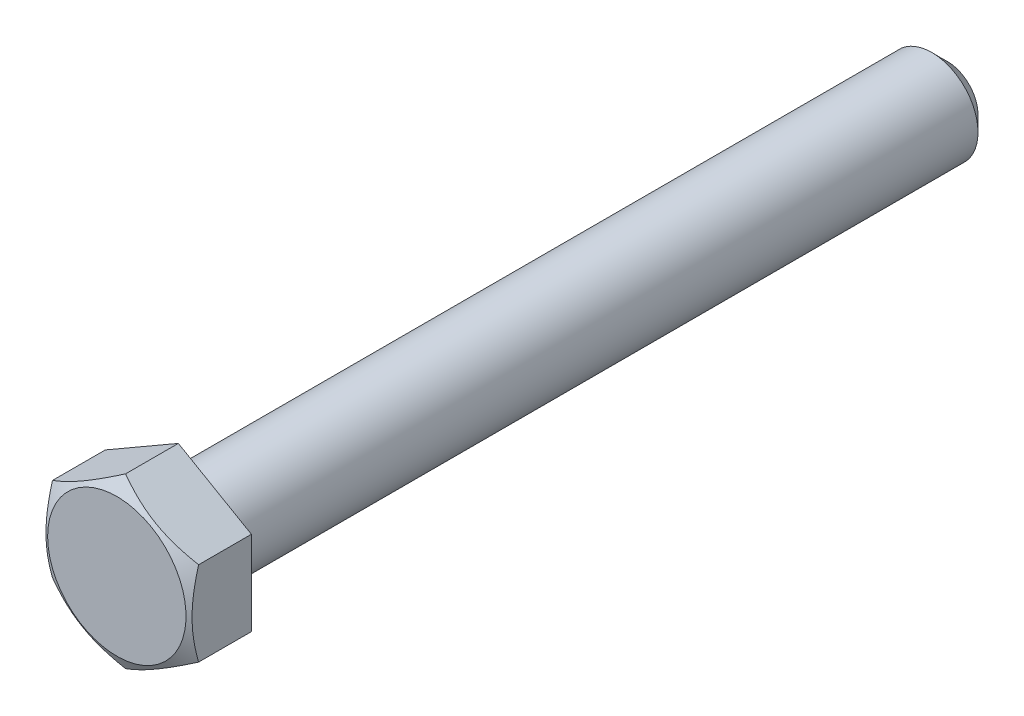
ISO-10303-21;
HEADER;
FILE_DESCRIPTION(('STEP AP214'),'2;1');
FILE_NAME('part.step','',(''),(''),'','','');
FILE_SCHEMA(('AUTOMOTIVE_DESIGN { 1 0 10303 214 1 1 1 1 }'));
ENDSEC;
DATA;
#1=APPLICATION_CONTEXT('core data for automotive mechanical design processes');
#2=APPLICATION_PROTOCOL_DEFINITION('international standard','automotive_design',2000,#1);
#3=PRODUCT_CONTEXT('',#1,'mechanical');
#4=PRODUCT('Part','Part','',(#3));
#5=PRODUCT_RELATED_PRODUCT_CATEGORY('part','',(#4));
#6=PRODUCT_DEFINITION_FORMATION('','',#4);
#7=PRODUCT_DEFINITION_CONTEXT('part definition',#1,'design');
#8=PRODUCT_DEFINITION('design','',#6,#7);
#9=PRODUCT_DEFINITION_SHAPE('','',#8);
#10=(LENGTH_UNIT() NAMED_UNIT(*) SI_UNIT(.MILLI.,.METRE.));
#11=(NAMED_UNIT(*) PLANE_ANGLE_UNIT() SI_UNIT($,.RADIAN.));
#12=(NAMED_UNIT(*) SI_UNIT($,.STERADIAN.) SOLID_ANGLE_UNIT());
#13=UNCERTAINTY_MEASURE_WITH_UNIT(LENGTH_MEASURE(1.E-05),#10,'distance_accuracy_value','');
#14=(GEOMETRIC_REPRESENTATION_CONTEXT(3) GLOBAL_UNCERTAINTY_ASSIGNED_CONTEXT((#13)) GLOBAL_UNIT_ASSIGNED_CONTEXT((#10,
#11,#12)) REPRESENTATION_CONTEXT('',''));
#15=CARTESIAN_POINT('',(0.,0.,0.));
#16=DIRECTION('',(0.,0.,1.));
#17=DIRECTION('',(1.,0.,0.));
#18=AXIS2_PLACEMENT_3D('',#15,#16,#17);
#19=CARTESIAN_POINT('',(0.,10.9696551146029,0.));
#20=DIRECTION('',(0.,0.,1.));
#21=DIRECTION('',(1.,0.,0.));
#22=AXIS2_PLACEMENT_3D('',#19,#20,#21);
#23=PLANE('',#22);
#24=DIRECTION('',(-0.866025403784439,0.5,0.));
#25=VECTOR('',#24,1.);
#26=CARTESIAN_POINT('',(9.5,5.48482755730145,0.));
#27=LINE('',#26,#25);
#28=CARTESIAN_POINT('',(9.5,5.48482755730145,0.));
#29=VERTEX_POINT('',#28);
#30=CARTESIAN_POINT('',(0.,10.9696551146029,0.));
#31=VERTEX_POINT('',#30);
#32=EDGE_CURVE('E77',#29,#31,#27,.T.);
#33=ORIENTED_EDGE('',*,*,#32,.F.);
#34=DIRECTION('',(0.,1.,0.));
#35=VECTOR('',#34,1.);
#36=CARTESIAN_POINT('',(9.5,-5.48482755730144,0.));
#37=LINE('',#36,#35);
#38=CARTESIAN_POINT('',(9.5,-5.48482755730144,0.));
#39=VERTEX_POINT('',#38);
#40=EDGE_CURVE('E82',#39,#29,#37,.T.);
#41=ORIENTED_EDGE('',*,*,#40,.F.);
#42=DIRECTION('',(0.866025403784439,0.5,0.));
#43=VECTOR('',#42,1.);
#44=CARTESIAN_POINT('',(0.,-10.9696551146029,0.));
#45=LINE('',#44,#43);
#46=CARTESIAN_POINT('',(0.,-10.9696551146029,0.));
#47=VERTEX_POINT('',#46);
#48=EDGE_CURVE('E88',#47,#39,#45,.T.);
#49=ORIENTED_EDGE('',*,*,#48,.F.);
#50=DIRECTION('',(0.866025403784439,-0.5,0.));
#51=VECTOR('',#50,1.);
#52=CARTESIAN_POINT('',(-9.5,-5.48482755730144,0.));
#53=LINE('',#52,#51);
#54=CARTESIAN_POINT('',(-9.5,-5.48482755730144,0.));
#55=VERTEX_POINT('',#54);
#56=EDGE_CURVE('E199',#55,#47,#53,.T.);
#57=ORIENTED_EDGE('',*,*,#56,.F.);
#58=DIRECTION('',(0.,-1.,0.));
#59=VECTOR('',#58,1.);
#60=CARTESIAN_POINT('',(-9.5,5.48482755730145,0.));
#61=LINE('',#60,#59);
#62=CARTESIAN_POINT('',(-9.5,5.48482755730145,0.));
#63=VERTEX_POINT('',#62);
#64=EDGE_CURVE('E209',#63,#55,#61,.T.);
#65=ORIENTED_EDGE('',*,*,#64,.F.);
#66=DIRECTION('',(-0.866025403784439,-0.5,0.));
#67=VECTOR('',#66,1.);
#68=CARTESIAN_POINT('',(0.,10.9696551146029,0.));
#69=LINE('',#68,#67);
#70=EDGE_CURVE('E207',#31,#63,#69,.T.);
#71=ORIENTED_EDGE('',*,*,#70,.F.);
#72=EDGE_LOOP('',(#33,#41,#49,#57,#65,#71));
#73=FACE_BOUND('',#72,.T.);
#74=CARTESIAN_POINT('',(0.,0.,0.));
#75=DIRECTION('',(0.,0.,1.));
#76=DIRECTION('',(1.,0.,0.));
#77=AXIS2_PLACEMENT_3D('',#74,#75,#76);
#78=CIRCLE('',#77,6.);
#79=CARTESIAN_POINT('',(6.,0.,0.));
#80=VERTEX_POINT('',#79);
#81=EDGE_CURVE('E98',#80,#80,#78,.F.);
#82=ORIENTED_EDGE('',*,*,#81,.F.);
#83=EDGE_LOOP('',(#82));
#84=FACE_BOUND('',#83,.T.);
#85=ADVANCED_FACE('F14',(#73,#84),#23,.F.);
#86=CARTESIAN_POINT('',(9.5,5.48482755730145,8.));
#87=DIRECTION('',(-0.5,-0.866025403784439,0.));
#88=DIRECTION('',(0.866025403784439,-0.5,0.));
#89=AXIS2_PLACEMENT_3D('',#86,#87,#88);
#90=PLANE('',#89);
#91=DIRECTION('',(0.,0.,-1.));
#92=VECTOR('',#91,1.);
#93=CARTESIAN_POINT('',(0.,10.9696551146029,8.));
#94=LINE('',#93,#92);
#95=CARTESIAN_POINT('',(0.,10.9696551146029,6.86281908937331));
#96=VERTEX_POINT('',#95);
#97=EDGE_CURVE('E76',#96,#31,#94,.T.);
#98=ORIENTED_EDGE('',*,*,#97,.F.);
#99=CARTESIAN_POINT('',(-0.0002,10.9697705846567,6.86275242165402));
#100=CARTESIAN_POINT('',(0.208630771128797,10.8492020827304,6.93235142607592));
#101=CARTESIAN_POINT('',(0.418240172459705,10.7281840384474,6.99879155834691));
#102=CARTESIAN_POINT('',(0.839139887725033,10.4851774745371,7.1244775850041));
#103=CARTESIAN_POINT('',(1.05043073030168,10.3631886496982,7.18372111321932));
#104=CARTESIAN_POINT('',(1.68770779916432,9.99525656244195,7.34951029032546));
#105=CARTESIAN_POINT('',(2.11620976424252,9.74786083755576,7.44381042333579));
#106=CARTESIAN_POINT('',(2.75744333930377,9.37764446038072,7.55438616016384));
#107=CARTESIAN_POINT('',(2.96825921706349,9.2559298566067,7.58588503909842));
#108=CARTESIAN_POINT('',(3.39086703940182,9.01193711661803,7.63870666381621));
#109=CARTESIAN_POINT('',(3.60265900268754,8.88965896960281,7.66002921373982));
#110=CARTESIAN_POINT('',(4.02659621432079,8.64489870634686,7.69195184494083));
#111=CARTESIAN_POINT('',(4.23874074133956,8.52241700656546,7.70256466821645));
#112=CARTESIAN_POINT('',(4.66322575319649,8.27734047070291,7.71284233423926));
#113=CARTESIAN_POINT('',(4.87556623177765,8.15474563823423,7.71250751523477));
#114=CARTESIAN_POINT('',(5.27254199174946,7.92555157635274,7.70165149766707));
#115=CARTESIAN_POINT('',(5.45720529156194,7.81893617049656,7.69245459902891));
#116=CARTESIAN_POINT('',(5.82610000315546,7.60595470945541,7.6659594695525));
#117=CARTESIAN_POINT('',(6.01033138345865,7.49958867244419,7.64866066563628));
#118=CARTESIAN_POINT('',(6.56231167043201,7.18090270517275,7.58502038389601));
#119=CARTESIAN_POINT('',(6.92908353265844,6.96914687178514,7.52694296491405));
#120=CARTESIAN_POINT('',(7.66651782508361,6.54338898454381,7.38174885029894));
#121=CARTESIAN_POINT('',(8.03708614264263,6.32944126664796,7.29401669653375));
#122=CARTESIAN_POINT('',(8.77269671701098,5.90473630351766,7.09490112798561));
#123=CARTESIAN_POINT('',(9.137748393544,5.6939736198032,6.98356447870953));
#124=CARTESIAN_POINT('',(9.5002,5.48471208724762,6.86275242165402));
#125=B_SPLINE_CURVE_WITH_KNOTS('',3,(#99,#100,#101,#102,#103,#104,#105,#106,#107,#108,#109,#110,
#111,#112,#113,#114,#115,#116,#117,#118,#119,#120,#121,#122,#123,#124),.UNSPECIFIED.,.F.,.F.,(4,
2,2,2,2,2,2,2,2,2,2,2,4),(0.,0.752880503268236,1.50600787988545,3.0154687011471,
3.75167336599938,4.48789219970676,5.22323407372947,5.95855322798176,6.59868084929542,
7.23885375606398,8.52010929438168,9.82978009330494,11.1368800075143),.UNSPECIFIED.);
#126=CARTESIAN_POINT('',(9.5,5.48482755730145,6.86281908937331));
#127=VERTEX_POINT('',#126);
#128=EDGE_CURVE('E68',#96,#127,#125,.T.);
#129=ORIENTED_EDGE('',*,*,#128,.T.);
#130=DIRECTION('',(0.,0.,-1.));
#131=VECTOR('',#130,1.);
#132=CARTESIAN_POINT('',(9.5,5.48482755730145,8.));
#133=LINE('',#132,#131);
#134=EDGE_CURVE('E37',#127,#29,#133,.T.);
#135=ORIENTED_EDGE('',*,*,#134,.T.);
#136=ORIENTED_EDGE('',*,*,#32,.T.);
#137=EDGE_LOOP('',(#98,#129,#135,#136));
#138=FACE_BOUND('',#137,.T.);
#139=ADVANCED_FACE('F75',(#138),#90,.F.);
#140=CARTESIAN_POINT('',(0.,10.9696551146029,8.));
#141=DIRECTION('',(0.5,-0.866025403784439,0.));
#142=DIRECTION('',(0.866025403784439,0.5,0.));
#143=AXIS2_PLACEMENT_3D('',#140,#141,#142);
#144=PLANE('',#143);
#145=DIRECTION('',(0.,0.,-1.));
#146=VECTOR('',#145,1.);
#147=CARTESIAN_POINT('',(-9.5,5.48482755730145,8.));
#148=LINE('',#147,#146);
#149=CARTESIAN_POINT('',(-9.5,5.48482755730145,6.86281908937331));
#150=VERTEX_POINT('',#149);
#151=EDGE_CURVE('E95',#150,#63,#148,.T.);
#152=ORIENTED_EDGE('',*,*,#151,.F.);
#153=CARTESIAN_POINT('',(-9.5002,5.48471208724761,6.86275242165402));
#154=CARTESIAN_POINT('',(-9.2913692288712,5.6052805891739,6.93235142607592));
#155=CARTESIAN_POINT('',(-9.0817598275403,5.72629863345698,6.99879155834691));
#156=CARTESIAN_POINT('',(-8.66086011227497,5.96930519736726,7.1244775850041));
#157=CARTESIAN_POINT('',(-8.44956926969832,6.09129402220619,7.18372111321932));
#158=CARTESIAN_POINT('',(-7.81229220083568,6.4592261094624,7.34951029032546));
#159=CARTESIAN_POINT('',(-7.38379023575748,6.70662183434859,7.44381042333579));
#160=CARTESIAN_POINT('',(-6.74255666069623,7.07683821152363,7.55438616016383));
#161=CARTESIAN_POINT('',(-6.53174078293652,7.19855281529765,7.58588503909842));
#162=CARTESIAN_POINT('',(-6.10913296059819,7.44254555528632,7.6387066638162));
#163=CARTESIAN_POINT('',(-5.89734099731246,7.56482370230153,7.66002921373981));
#164=CARTESIAN_POINT('',(-5.47340378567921,7.80958396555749,7.69195184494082));
#165=CARTESIAN_POINT('',(-5.26125925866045,7.93206566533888,7.70256466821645));
#166=CARTESIAN_POINT('',(-4.83677424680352,8.17714220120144,7.71284233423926));
#167=CARTESIAN_POINT('',(-4.62443376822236,8.29973703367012,7.71250751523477));
#168=CARTESIAN_POINT('',(-4.22745800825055,8.52893109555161,7.70165149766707));
#169=CARTESIAN_POINT('',(-4.04279470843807,8.63554650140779,7.6924545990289));
#170=CARTESIAN_POINT('',(-3.67389999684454,8.84852796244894,7.6659594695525));
#171=CARTESIAN_POINT('',(-3.48966861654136,8.95489399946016,7.64866066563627));
#172=CARTESIAN_POINT('',(-2.937688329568,9.27357996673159,7.585020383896));
#173=CARTESIAN_POINT('',(-2.57091646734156,9.48533580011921,7.52694296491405));
#174=CARTESIAN_POINT('',(-1.83348217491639,9.91109368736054,7.38174885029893));
#175=CARTESIAN_POINT('',(-1.46291385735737,10.1250414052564,7.29401669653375));
#176=CARTESIAN_POINT('',(-0.727303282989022,10.5497463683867,7.0949011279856));
#177=CARTESIAN_POINT('',(-0.362251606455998,10.7605090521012,6.98356447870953));
#178=CARTESIAN_POINT('',(0.000200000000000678,10.9697705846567,6.86275242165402));
#179=B_SPLINE_CURVE_WITH_KNOTS('',3,(#153,#154,#155,#156,#157,#158,#159,#160,#161,#162,#163,
#164,#165,#166,#167,#168,#169,#170,#171,#172,#173,#174,#175,#176,#177,#178),.UNSPECIFIED.,.F.,
.F.,(4,2,2,2,2,2,2,2,2,2,2,2,4),(0.,0.752880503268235,1.50600787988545,3.0154687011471,
3.75167336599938,4.48789219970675,5.22323407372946,5.95855322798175,6.59868084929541,
7.23885375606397,8.52010929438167,9.82978009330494,11.1368800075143),.UNSPECIFIED.);
#180=EDGE_CURVE('E78',#150,#96,#179,.T.);
#181=ORIENTED_EDGE('',*,*,#180,.T.);
#182=ORIENTED_EDGE('',*,*,#97,.T.);
#183=ORIENTED_EDGE('',*,*,#70,.T.);
#184=EDGE_LOOP('',(#152,#181,#182,#183));
#185=FACE_BOUND('',#184,.T.);
#186=ADVANCED_FACE('F122',(#185),#144,.F.);
#187=CARTESIAN_POINT('',(-9.5,5.48482755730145,8.));
#188=DIRECTION('',(1.,0.,0.));
#189=DIRECTION('',(0.,0.,-1.));
#190=AXIS2_PLACEMENT_3D('',#187,#188,#189);
#191=PLANE('',#190);
#192=DIRECTION('',(0.,0.,-1.));
#193=VECTOR('',#192,1.);
#194=CARTESIAN_POINT('',(-9.5,-5.48482755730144,8.));
#195=LINE('',#194,#193);
#196=CARTESIAN_POINT('',(-9.5,-5.48482755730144,6.86281908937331));
#197=VERTEX_POINT('',#196);
#198=EDGE_CURVE('E93',#197,#55,#195,.T.);
#199=ORIENTED_EDGE('',*,*,#198,.F.);
#200=CARTESIAN_POINT('',(-9.5,-14.6169548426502,3.13127340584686));
#201=CARTESIAN_POINT('',(-9.5,-14.4099741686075,3.23146887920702));
#202=CARTESIAN_POINT('',(-9.5,-14.202747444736,3.33115583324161));
#203=CARTESIAN_POINT('',(-9.5,-13.7877505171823,3.52939728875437));
#204=CARTESIAN_POINT('',(-9.5,-13.5799803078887,3.62795177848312));
#205=CARTESIAN_POINT('',(-9.5,-12.9557203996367,3.92177017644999));
#206=CARTESIAN_POINT('',(-9.5,-12.5383444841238,4.11515839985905));
#207=CARTESIAN_POINT('',(-9.5,-11.6984328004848,4.49680738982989));
#208=CARTESIAN_POINT('',(-9.5,-11.275881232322,4.68503347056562));
#209=CARTESIAN_POINT('',(-9.5,-10.427377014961,5.05362894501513));
#210=CARTESIAN_POINT('',(-9.5,-10.0014245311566,5.23399871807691));
#211=CARTESIAN_POINT('',(-9.5,-9.1321608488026,5.59024054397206));
#212=CARTESIAN_POINT('',(-9.5,-8.68872080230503,5.76579995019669));
#213=CARTESIAN_POINT('',(-9.5,-7.79661127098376,6.10334897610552));
#214=CARTESIAN_POINT('',(-9.5,-7.34794119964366,6.26533705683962));
#215=CARTESIAN_POINT('',(-9.5,-6.44553024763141,6.57140492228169));
#216=CARTESIAN_POINT('',(-9.5,-5.9918021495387,6.71552198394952));
#217=CARTESIAN_POINT('',(-9.5,-5.07785587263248,6.98114937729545));
#218=CARTESIAN_POINT('',(-9.5,-4.61763982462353,7.10266695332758));
#219=CARTESIAN_POINT('',(-9.5,-3.69290280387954,7.31654154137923));
#220=CARTESIAN_POINT('',(-9.5,-3.22841826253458,7.40905177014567));
#221=CARTESIAN_POINT('',(-9.5,-2.52755616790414,7.52199749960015));
#222=CARTESIAN_POINT('',(-9.5,-2.29322816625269,7.55534437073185));
#223=CARTESIAN_POINT('',(-9.5,-1.82344730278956,7.61277502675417));
#224=CARTESIAN_POINT('',(-9.5,-1.58799455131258,7.6368597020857));
#225=CARTESIAN_POINT('',(-9.5,-1.11930437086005,7.67498999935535));
#226=CARTESIAN_POINT('',(-9.5,-0.886077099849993,7.68916002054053));
#227=CARTESIAN_POINT('',(-9.5,-0.419232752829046,7.70763310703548));
#228=CARTESIAN_POINT('',(-9.5,-0.185615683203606,7.71193633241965));
#229=CARTESIAN_POINT('',(-9.5,0.281592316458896,7.71057344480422));
#230=CARTESIAN_POINT('',(-9.5,0.515183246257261,7.70490724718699));
#231=CARTESIAN_POINT('',(-9.5,0.981922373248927,7.68374176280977));
#232=CARTESIAN_POINT('',(-9.5,1.2150705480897,7.66824199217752));
#233=CARTESIAN_POINT('',(-9.5,1.77895072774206,7.61918755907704));
#234=CARTESIAN_POINT('',(-9.5,2.10926686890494,7.5807701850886));
#235=CARTESIAN_POINT('',(-9.5,2.7673725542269,7.48631778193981));
#236=CARTESIAN_POINT('',(-9.5,3.09516173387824,7.43028025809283));
#237=CARTESIAN_POINT('',(-9.5,3.7479266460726,7.30258122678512));
#238=CARTESIAN_POINT('',(-9.5,4.07289990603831,7.23090720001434));
#239=CARTESIAN_POINT('',(-9.5,4.71955029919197,7.07411533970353));
#240=CARTESIAN_POINT('',(-9.5,5.04122748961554,6.98899774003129));
#241=CARTESIAN_POINT('',(-9.5,5.68830445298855,6.80538640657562));
#242=CARTESIAN_POINT('',(-9.5,6.01363245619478,6.70664147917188));
#243=CARTESIAN_POINT('',(-9.5,6.66108251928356,6.4992006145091));
#244=CARTESIAN_POINT('',(-9.5,6.98320455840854,6.39050461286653));
#245=CARTESIAN_POINT('',(-9.5,7.62440641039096,6.16486538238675));
#246=CARTESIAN_POINT('',(-9.5,7.94348725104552,6.04792506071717));
#247=CARTESIAN_POINT('',(-9.5,8.57902170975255,5.80714824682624));
#248=CARTESIAN_POINT('',(-9.5,8.89547535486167,5.68331182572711));
#249=CARTESIAN_POINT('',(-9.5,9.62674986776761,5.38942439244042));
#250=CARTESIAN_POINT('',(-9.5,10.0407133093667,5.21724339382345));
#251=CARTESIAN_POINT('',(-9.5,10.8652589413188,4.86494520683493));
#252=CARTESIAN_POINT('',(-9.5,11.2758409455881,4.68482758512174));
#253=CARTESIAN_POINT('',(-9.5,12.0942342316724,4.31820457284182));
#254=CARTESIAN_POINT('',(-9.5,12.5020449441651,4.1316979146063));
#255=CARTESIAN_POINT('',(-9.5,13.31526398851,3.75355025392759));
#256=CARTESIAN_POINT('',(-9.5,13.7206723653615,3.56190934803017));
#257=CARTESIAN_POINT('',(-9.5,14.5298828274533,3.17423557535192));
#258=CARTESIAN_POINT('',(-9.5,14.9336828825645,2.97819847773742));
#259=CARTESIAN_POINT('',(-9.5,15.7395764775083,2.58264906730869));
#260=CARTESIAN_POINT('',(-9.5,16.1416700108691,2.3831367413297));
#261=CARTESIAN_POINT('',(-9.5,17.3456966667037,1.78033515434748));
#262=CARTESIAN_POINT('',(-9.5,18.1454714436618,1.37273512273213));
#263=CARTESIAN_POINT('',(-9.5,19.6765506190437,0.58254582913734));
#264=CARTESIAN_POINT('',(-9.5,20.4081814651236,0.200586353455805));
#265=CARTESIAN_POINT('',(-9.5,21.8687212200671,-0.568553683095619));
#266=CARTESIAN_POINT('',(-9.5,22.5976300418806,-0.955734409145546));
#267=CARTESIAN_POINT('',(-9.5,24.0516280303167,-1.73318767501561));
#268=CARTESIAN_POINT('',(-9.5,24.7767221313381,-2.12345100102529));
#269=CARTESIAN_POINT('',(-9.5,26.2251609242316,-2.90712368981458));
#270=CARTESIAN_POINT('',(-9.5,26.9485057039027,-3.30053289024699));
#271=CARTESIAN_POINT('',(-9.5,27.671202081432,-3.69512170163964));
#272=B_SPLINE_CURVE_WITH_KNOTS('',3,(#200,#201,#202,#203,#204,#205,#206,#207,#208,#209,#210,
#211,#212,#213,#214,#215,#216,#217,#218,#219,#220,#221,#222,#223,#224,#225,#226,#227,#228,#229,
#230,#231,#232,#233,#234,#235,#236,#237,#238,#239,#240,#241,#242,#243,#244,#245,#246,#247,#248,
#249,#250,#251,#252,#253,#254,#255,#256,#257,#258,#259,#260,#261,#262,#263,#264,#265,#266,#267,
#268,#269,#270,#271),.UNSPECIFIED.,.F.,.F.,(4,2,2,2,2,2,2,2,2,2,2,2,2,2,2,2,2,2,2,2,2,2,2,2,2,2,
2,2,2,2,2,2,2,2,2,4),(0.,0.689869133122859,1.37974541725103,2.759708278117,4.14738140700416,
5.53498745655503,6.96559884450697,8.39637224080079,9.82410912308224,11.2513875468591,
12.670994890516,13.3809072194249,14.0907512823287,14.7915209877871,15.492279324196,
16.1930436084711,16.8938423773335,17.8909161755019,18.8881312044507,19.8861475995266,
20.8841466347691,21.9039067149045,22.923673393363,23.9430822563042,24.9624806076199,
26.307400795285,27.6523945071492,28.9976566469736,30.3428935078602,31.6894858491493,
33.0360832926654,35.7289597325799,38.2049401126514,40.6809990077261,43.1513353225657,
45.6215449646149),.UNSPECIFIED.);
#273=EDGE_CURVE('E160',#197,#150,#272,.T.);
#274=ORIENTED_EDGE('',*,*,#273,.T.);
#275=ORIENTED_EDGE('',*,*,#151,.T.);
#276=ORIENTED_EDGE('',*,*,#64,.T.);
#277=EDGE_LOOP('',(#199,#274,#275,#276));
#278=FACE_BOUND('',#277,.T.);
#279=ADVANCED_FACE('F179',(#278),#191,.F.);
#280=CARTESIAN_POINT('',(-9.5,-5.48482755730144,8.));
#281=DIRECTION('',(0.5,0.866025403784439,0.));
#282=DIRECTION('',(-0.866025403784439,0.5,0.));
#283=AXIS2_PLACEMENT_3D('',#280,#281,#282);
#284=PLANE('',#283);
#285=DIRECTION('',(0.,0.,-1.));
#286=VECTOR('',#285,1.);
#287=CARTESIAN_POINT('',(0.,-10.9696551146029,8.));
#288=LINE('',#287,#286);
#289=CARTESIAN_POINT('',(0.,-10.9696551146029,6.86281908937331));
#290=VERTEX_POINT('',#289);
#291=EDGE_CURVE('E86',#290,#47,#288,.T.);
#292=ORIENTED_EDGE('',*,*,#291,.F.);
#293=CARTESIAN_POINT('',(0.000199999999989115,-10.9697705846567,6.86275242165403));
#294=CARTESIAN_POINT('',(-0.20863077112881,-10.8492020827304,6.93235142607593));
#295=CARTESIAN_POINT('',(-0.418240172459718,-10.7281840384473,6.99879155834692));
#296=CARTESIAN_POINT('',(-0.839139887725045,-10.4851774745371,7.12447758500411));
#297=CARTESIAN_POINT('',(-1.05043073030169,-10.3631886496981,7.18372111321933));
#298=CARTESIAN_POINT('',(-1.68770779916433,-9.99525656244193,7.34951029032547));
#299=CARTESIAN_POINT('',(-2.11620976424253,-9.74786083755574,7.4438104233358));
#300=CARTESIAN_POINT('',(-2.75744333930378,-9.3776444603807,7.55438616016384));
#301=CARTESIAN_POINT('',(-2.96825921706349,-9.25592985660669,7.58588503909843));
#302=CARTESIAN_POINT('',(-3.39086703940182,-9.01193711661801,7.63870666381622));
#303=CARTESIAN_POINT('',(-3.60265900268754,-8.8896589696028,7.66002921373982));
#304=CARTESIAN_POINT('',(-4.0265962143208,-8.64489870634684,7.69195184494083));
#305=CARTESIAN_POINT('',(-4.23874074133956,-8.52241700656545,7.70256466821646));
#306=CARTESIAN_POINT('',(-4.66322575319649,-8.2773404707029,7.71284233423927));
#307=CARTESIAN_POINT('',(-4.87556623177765,-8.15474563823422,7.71250751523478));
#308=CARTESIAN_POINT('',(-5.27254199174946,-7.92555157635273,7.70165149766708));
#309=CARTESIAN_POINT('',(-5.45720529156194,-7.81893617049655,7.69245459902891));
#310=CARTESIAN_POINT('',(-5.82610000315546,-7.60595470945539,7.66595946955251));
#311=CARTESIAN_POINT('',(-6.01033138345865,-7.49958867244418,7.64866066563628));
#312=CARTESIAN_POINT('',(-6.56231167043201,-7.18090270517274,7.58502038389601));
#313=CARTESIAN_POINT('',(-6.92908353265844,-6.96914687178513,7.52694296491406));
#314=CARTESIAN_POINT('',(-7.66651782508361,-6.5433889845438,7.38174885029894));
#315=CARTESIAN_POINT('',(-8.03708614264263,-6.32944126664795,7.29401669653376));
#316=CARTESIAN_POINT('',(-8.77269671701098,-5.90473630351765,7.09490112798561));
#317=CARTESIAN_POINT('',(-9.137748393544,-5.69397361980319,6.98356447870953));
#318=CARTESIAN_POINT('',(-9.5002,-5.48471208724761,6.86275242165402));
#319=B_SPLINE_CURVE_WITH_KNOTS('',3,(#293,#294,#295,#296,#297,#298,#299,#300,#301,#302,#303,
#304,#305,#306,#307,#308,#309,#310,#311,#312,#313,#314,#315,#316,#317,#318),.UNSPECIFIED.,.F.,
.F.,(4,2,2,2,2,2,2,2,2,2,2,2,4),(0.,0.752880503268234,1.50600787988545,3.01546870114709,
3.75167336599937,4.48789219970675,5.22323407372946,5.95855322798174,6.5986808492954,
7.23885375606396,8.52010929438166,9.82978009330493,11.1368800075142),.UNSPECIFIED.);
#320=EDGE_CURVE('E154',#290,#197,#319,.T.);
#321=ORIENTED_EDGE('',*,*,#320,.T.);
#322=ORIENTED_EDGE('',*,*,#198,.T.);
#323=ORIENTED_EDGE('',*,*,#56,.T.);
#324=EDGE_LOOP('',(#292,#321,#322,#323));
#325=FACE_BOUND('',#324,.T.);
#326=ADVANCED_FACE('F184',(#325),#284,.F.);
#327=CARTESIAN_POINT('',(0.,-10.9696551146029,8.));
#328=DIRECTION('',(-0.5,0.866025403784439,0.));
#329=DIRECTION('',(-0.866025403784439,-0.5,0.));
#330=AXIS2_PLACEMENT_3D('',#327,#328,#329);
#331=PLANE('',#330);
#332=DIRECTION('',(0.,0.,-1.));
#333=VECTOR('',#332,1.);
#334=CARTESIAN_POINT('',(9.5,-5.48482755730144,8.));
#335=LINE('',#334,#333);
#336=CARTESIAN_POINT('',(9.5,-5.48482755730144,6.86281908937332));
#337=VERTEX_POINT('',#336);
#338=EDGE_CURVE('E84',#337,#39,#335,.T.);
#339=ORIENTED_EDGE('',*,*,#338,.F.);
#340=CARTESIAN_POINT('',(9.5002,-5.4847120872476,6.86275242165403));
#341=CARTESIAN_POINT('',(9.2913692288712,-5.6052805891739,6.93235142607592));
#342=CARTESIAN_POINT('',(9.0817598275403,-5.72629863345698,6.99879155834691));
#343=CARTESIAN_POINT('',(8.66086011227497,-5.96930519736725,7.1244775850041));
#344=CARTESIAN_POINT('',(8.44956926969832,-6.09129402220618,7.18372111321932));
#345=CARTESIAN_POINT('',(7.81229220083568,-6.4592261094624,7.34951029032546));
#346=CARTESIAN_POINT('',(7.38379023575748,-6.70662183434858,7.4438104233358));
#347=CARTESIAN_POINT('',(6.74255666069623,-7.07683821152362,7.55438616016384));
#348=CARTESIAN_POINT('',(6.53174078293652,-7.19855281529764,7.58588503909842));
#349=CARTESIAN_POINT('',(6.10913296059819,-7.44254555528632,7.63870666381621));
#350=CARTESIAN_POINT('',(5.89734099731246,-7.56482370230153,7.66002921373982));
#351=CARTESIAN_POINT('',(5.47340378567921,-7.80958396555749,7.69195184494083));
#352=CARTESIAN_POINT('',(5.26125925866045,-7.93206566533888,7.70256466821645));
#353=CARTESIAN_POINT('',(4.83677424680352,-8.17714220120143,7.71284233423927));
#354=CARTESIAN_POINT('',(4.62443376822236,-8.29973703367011,7.71250751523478));
#355=CARTESIAN_POINT('',(4.22745800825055,-8.5289310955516,7.70165149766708));
#356=CARTESIAN_POINT('',(4.04279470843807,-8.63554650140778,7.69245459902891));
#357=CARTESIAN_POINT('',(3.67389999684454,-8.84852796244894,7.6659594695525));
#358=CARTESIAN_POINT('',(3.48966861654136,-8.95489399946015,7.64866066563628));
#359=CARTESIAN_POINT('',(2.937688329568,-9.27357996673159,7.58502038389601));
#360=CARTESIAN_POINT('',(2.57091646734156,-9.4853358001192,7.52694296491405));
#361=CARTESIAN_POINT('',(1.83348217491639,-9.91109368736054,7.38174885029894));
#362=CARTESIAN_POINT('',(1.46291385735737,-10.1250414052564,7.29401669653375));
#363=CARTESIAN_POINT('',(0.727303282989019,-10.5497463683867,7.09490112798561));
#364=CARTESIAN_POINT('',(0.362251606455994,-10.7605090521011,6.98356447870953));
#365=CARTESIAN_POINT('',(-0.000200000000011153,-10.9697705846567,6.86275242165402));
#366=B_SPLINE_CURVE_WITH_KNOTS('',3,(#340,#341,#342,#343,#344,#345,#346,#347,#348,#349,#350,
#351,#352,#353,#354,#355,#356,#357,#358,#359,#360,#361,#362,#363,#364,#365),.UNSPECIFIED.,.F.,
.F.,(4,2,2,2,2,2,2,2,2,2,2,2,4),(0.,0.752880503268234,1.50600787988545,3.0154687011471,
3.75167336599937,4.48789219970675,5.22323407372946,5.95855322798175,6.59868084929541,
7.23885375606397,8.52010929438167,9.82978009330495,11.1368800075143),.UNSPECIFIED.);
#367=EDGE_CURVE('E29',#337,#290,#366,.T.);
#368=ORIENTED_EDGE('',*,*,#367,.T.);
#369=ORIENTED_EDGE('',*,*,#291,.T.);
#370=ORIENTED_EDGE('',*,*,#48,.T.);
#371=EDGE_LOOP('',(#339,#368,#369,#370));
#372=FACE_BOUND('',#371,.T.);
#373=ADVANCED_FACE('F131',(#372),#331,.F.);
#374=CARTESIAN_POINT('',(9.5,-5.48482755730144,8.));
#375=DIRECTION('',(-1.,0.,0.));
#376=DIRECTION('',(0.,-1.,0.));
#377=AXIS2_PLACEMENT_3D('',#374,#375,#376);
#378=PLANE('',#377);
#379=ORIENTED_EDGE('',*,*,#134,.F.);
#380=CARTESIAN_POINT('',(9.5,-14.6169548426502,3.13127340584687));
#381=CARTESIAN_POINT('',(9.5,-14.4099741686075,3.23146887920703));
#382=CARTESIAN_POINT('',(9.49999999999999,-14.202747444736,3.33115583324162));
#383=CARTESIAN_POINT('',(9.49999999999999,-13.7877505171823,3.52939728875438));
#384=CARTESIAN_POINT('',(9.49999999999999,-13.5799803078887,3.62795177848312));
#385=CARTESIAN_POINT('',(9.49999999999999,-12.9557203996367,3.92177017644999));
#386=CARTESIAN_POINT('',(9.5,-12.5383444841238,4.11515839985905));
#387=CARTESIAN_POINT('',(9.5,-11.6984328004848,4.4968073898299));
#388=CARTESIAN_POINT('',(9.5,-11.275881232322,4.68503347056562));
#389=CARTESIAN_POINT('',(9.5,-10.427377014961,5.05362894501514));
#390=CARTESIAN_POINT('',(9.5,-10.0014245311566,5.23399871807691));
#391=CARTESIAN_POINT('',(9.5,-9.1321608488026,5.59024054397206));
#392=CARTESIAN_POINT('',(9.5,-8.68872080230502,5.7657999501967));
#393=CARTESIAN_POINT('',(9.5,-7.79661127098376,6.10334897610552));
#394=CARTESIAN_POINT('',(9.5,-7.34794119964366,6.26533705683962));
#395=CARTESIAN_POINT('',(9.5,-6.44553024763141,6.57140492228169));
#396=CARTESIAN_POINT('',(9.5,-5.9918021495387,6.71552198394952));
#397=CARTESIAN_POINT('',(9.5,-5.07785587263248,6.98114937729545));
#398=CARTESIAN_POINT('',(9.5,-4.61763982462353,7.10266695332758));
#399=CARTESIAN_POINT('',(9.5,-3.69290280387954,7.31654154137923));
#400=CARTESIAN_POINT('',(9.5,-3.22841826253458,7.40905177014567));
#401=CARTESIAN_POINT('',(9.5,-2.52755616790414,7.52199749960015));
#402=CARTESIAN_POINT('',(9.5,-2.29322816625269,7.55534437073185));
#403=CARTESIAN_POINT('',(9.5,-1.82344730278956,7.61277502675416));
#404=CARTESIAN_POINT('',(9.5,-1.58799455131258,7.63685970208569));
#405=CARTESIAN_POINT('',(9.5,-1.11930437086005,7.67498999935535));
#406=CARTESIAN_POINT('',(9.5,-0.886077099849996,7.68916002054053));
#407=CARTESIAN_POINT('',(9.5,-0.419232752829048,7.70763310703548));
#408=CARTESIAN_POINT('',(9.5,-0.185615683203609,7.71193633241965));
#409=CARTESIAN_POINT('',(9.5,0.281592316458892,7.71057344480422));
#410=CARTESIAN_POINT('',(9.50000000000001,0.515183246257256,7.70490724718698));
#411=CARTESIAN_POINT('',(9.5,0.981922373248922,7.68374176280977));
#412=CARTESIAN_POINT('',(9.5,1.2150705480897,7.66824199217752));
#413=CARTESIAN_POINT('',(9.5,1.77895072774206,7.61918755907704));
#414=CARTESIAN_POINT('',(9.5,2.10926686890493,7.5807701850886));
#415=CARTESIAN_POINT('',(9.50000000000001,2.76737255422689,7.4863177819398));
#416=CARTESIAN_POINT('',(9.50000000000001,3.09516173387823,7.43028025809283));
#417=CARTESIAN_POINT('',(9.50000000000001,3.74792664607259,7.30258122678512));
#418=CARTESIAN_POINT('',(9.50000000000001,4.0728999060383,7.23090720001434));
#419=CARTESIAN_POINT('',(9.50000000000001,4.71955029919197,7.07411533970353));
#420=CARTESIAN_POINT('',(9.50000000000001,5.04122748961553,6.98899774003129));
#421=CARTESIAN_POINT('',(9.50000000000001,5.68830445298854,6.80538640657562));
#422=CARTESIAN_POINT('',(9.50000000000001,6.01363245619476,6.70664147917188));
#423=CARTESIAN_POINT('',(9.50000000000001,6.66108251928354,6.4992006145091));
#424=CARTESIAN_POINT('',(9.50000000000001,6.98320455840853,6.39050461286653));
#425=CARTESIAN_POINT('',(9.50000000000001,7.62440641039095,6.16486538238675));
#426=CARTESIAN_POINT('',(9.50000000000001,7.94348725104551,6.04792506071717));
#427=CARTESIAN_POINT('',(9.50000000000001,8.57902170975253,5.80714824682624));
#428=CARTESIAN_POINT('',(9.5,8.89547535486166,5.68331182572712));
#429=CARTESIAN_POINT('',(9.5,9.6267498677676,5.38942439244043));
#430=CARTESIAN_POINT('',(9.50000000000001,10.0407133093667,5.21724339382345));
#431=CARTESIAN_POINT('',(9.50000000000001,10.8652589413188,4.86494520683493));
#432=CARTESIAN_POINT('',(9.50000000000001,11.2758409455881,4.68482758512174));
#433=CARTESIAN_POINT('',(9.50000000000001,12.0942342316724,4.31820457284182));
#434=CARTESIAN_POINT('',(9.50000000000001,12.502044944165,4.1316979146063));
#435=CARTESIAN_POINT('',(9.50000000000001,13.3152639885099,3.75355025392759));
#436=CARTESIAN_POINT('',(9.50000000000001,13.7206723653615,3.56190934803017));
#437=CARTESIAN_POINT('',(9.50000000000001,14.5298828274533,3.17423557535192));
#438=CARTESIAN_POINT('',(9.50000000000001,14.9336828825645,2.97819847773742));
#439=CARTESIAN_POINT('',(9.50000000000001,15.7395764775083,2.58264906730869));
#440=CARTESIAN_POINT('',(9.50000000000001,16.1416700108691,2.3831367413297));
#441=CARTESIAN_POINT('',(9.50000000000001,17.3456966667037,1.78033515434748));
#442=CARTESIAN_POINT('',(9.50000000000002,18.1454714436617,1.37273512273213));
#443=CARTESIAN_POINT('',(9.50000000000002,19.6765506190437,0.58254582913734));
#444=CARTESIAN_POINT('',(9.50000000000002,20.4081814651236,0.200586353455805));
#445=CARTESIAN_POINT('',(9.50000000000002,21.8687212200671,-0.568553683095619));
#446=CARTESIAN_POINT('',(9.50000000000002,22.5976300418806,-0.955734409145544));
#447=CARTESIAN_POINT('',(9.50000000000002,24.0516280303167,-1.73318767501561));
#448=CARTESIAN_POINT('',(9.50000000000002,24.776722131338,-2.12345100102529));
#449=CARTESIAN_POINT('',(9.50000000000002,26.2251609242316,-2.90712368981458));
#450=CARTESIAN_POINT('',(9.50000000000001,26.9485057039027,-3.30053289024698));
#451=CARTESIAN_POINT('',(9.5,27.671202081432,-3.69512170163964));
#452=B_SPLINE_CURVE_WITH_KNOTS('',3,(#380,#381,#382,#383,#384,#385,#386,#387,#388,#389,#390,
#391,#392,#393,#394,#395,#396,#397,#398,#399,#400,#401,#402,#403,#404,#405,#406,#407,#408,#409,
#410,#411,#412,#413,#414,#415,#416,#417,#418,#419,#420,#421,#422,#423,#424,#425,#426,#427,#428,
#429,#430,#431,#432,#433,#434,#435,#436,#437,#438,#439,#440,#441,#442,#443,#444,#445,#446,#447,
#448,#449,#450,#451),.UNSPECIFIED.,.F.,.F.,(4,2,2,2,2,2,2,2,2,2,2,2,2,2,2,2,2,2,2,2,2,2,2,2,2,2,
2,2,2,2,2,2,2,2,2,4),(0.,0.689869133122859,1.37974541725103,2.759708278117,4.14738140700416,
5.53498745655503,6.96559884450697,8.39637224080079,9.82410912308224,11.251387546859,
12.670994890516,13.3809072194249,14.0907512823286,14.7915209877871,15.492279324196,
16.1930436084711,16.8938423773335,17.8909161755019,18.8881312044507,19.8861475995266,
20.8841466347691,21.9039067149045,22.923673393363,23.9430822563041,24.9624806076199,
26.307400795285,27.6523945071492,28.9976566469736,30.3428935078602,31.6894858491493,
33.0360832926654,35.7289597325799,38.2049401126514,40.6809990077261,43.1513353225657,
45.6215449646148),.UNSPECIFIED.);
#453=EDGE_CURVE('E66',#127,#337,#452,.F.);
#454=ORIENTED_EDGE('',*,*,#453,.T.);
#455=ORIENTED_EDGE('',*,*,#338,.T.);
#456=ORIENTED_EDGE('',*,*,#40,.T.);
#457=EDGE_LOOP('',(#379,#454,#455,#456));
#458=FACE_BOUND('',#457,.T.);
#459=ADVANCED_FACE('F80',(#458),#378,.F.);
#460=CARTESIAN_POINT('',(0.,0.,8.));
#461=DIRECTION('',(0.,0.,-1.));
#462=DIRECTION('',(-1.,0.,0.));
#463=AXIS2_PLACEMENT_3D('',#460,#461,#462);
#464=CONICAL_SURFACE('',#463,9.,1.0471975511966);
#465=CARTESIAN_POINT('',(0.,0.,8.));
#466=DIRECTION('',(0.,0.,-1.));
#467=DIRECTION('',(-1.,0.,0.));
#468=AXIS2_PLACEMENT_3D('',#465,#466,#467);
#469=CIRCLE('',#468,9.);
#470=CARTESIAN_POINT('',(-9.,0.,8.));
#471=VERTEX_POINT('',#470);
#472=EDGE_CURVE('E72',#471,#471,#469,.T.);
#473=ORIENTED_EDGE('',*,*,#472,.T.);
#474=EDGE_LOOP('',(#473));
#475=FACE_BOUND('',#474,.T.);
#476=ORIENTED_EDGE('',*,*,#180,.F.);
#477=ORIENTED_EDGE('',*,*,#273,.F.);
#478=ORIENTED_EDGE('',*,*,#320,.F.);
#479=ORIENTED_EDGE('',*,*,#367,.F.);
#480=ORIENTED_EDGE('',*,*,#453,.F.);
#481=ORIENTED_EDGE('',*,*,#128,.F.);
#482=EDGE_LOOP('',(#476,#477,#478,#479,#480,#481));
#483=FACE_BOUND('',#482,.T.);
#484=ADVANCED_FACE('F67',(#475,#483),#464,.T.);
#485=CARTESIAN_POINT('',(0.,10.9696551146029,8.));
#486=DIRECTION('',(0.,0.,1.));
#487=DIRECTION('',(1.,0.,0.));
#488=AXIS2_PLACEMENT_3D('',#485,#486,#487);
#489=PLANE('',#488);
#490=ORIENTED_EDGE('',*,*,#472,.F.);
#491=EDGE_LOOP('',(#490));
#492=FACE_BOUND('',#491,.T.);
#493=ADVANCED_FACE('F126',(#492),#489,.T.);
#494=CARTESIAN_POINT('',(0.,0.,-100.));
#495=DIRECTION('',(0.,0.,1.));
#496=DIRECTION('',(1.,0.,0.));
#497=AXIS2_PLACEMENT_3D('',#494,#495,#496);
#498=CYLINDRICAL_SURFACE('',#497,6.);
#499=CARTESIAN_POINT('',(0.,0.,-98.));
#500=DIRECTION('',(0.,0.,-1.));
#501=DIRECTION('',(-1.,0.,0.));
#502=AXIS2_PLACEMENT_3D('',#499,#500,#501);
#503=CIRCLE('',#502,6.);
#504=CARTESIAN_POINT('',(-6.,0.,-98.));
#505=VERTEX_POINT('',#504);
#506=EDGE_CURVE('E9',#505,#505,#503,.F.);
#507=ORIENTED_EDGE('',*,*,#506,.T.);
#508=EDGE_LOOP('',(#507));
#509=FACE_BOUND('',#508,.T.);
#510=ORIENTED_EDGE('',*,*,#81,.T.);
#511=EDGE_LOOP('',(#510));
#512=FACE_BOUND('',#511,.T.);
#513=ADVANCED_FACE('F112',(#509,#512),#498,.T.);
#514=CARTESIAN_POINT('',(0.,0.,-100.));
#515=DIRECTION('',(0.,0.,-1.));
#516=DIRECTION('',(-1.,0.,0.));
#517=AXIS2_PLACEMENT_3D('',#514,#515,#516);
#518=PLANE('',#517);
#519=CARTESIAN_POINT('',(0.,0.,-100.));
#520=DIRECTION('',(0.,0.,-1.));
#521=DIRECTION('',(-1.,0.,0.));
#522=AXIS2_PLACEMENT_3D('',#519,#520,#521);
#523=CIRCLE('',#522,4.);
#524=CARTESIAN_POINT('',(-4.,0.,-100.));
#525=VERTEX_POINT('',#524);
#526=EDGE_CURVE('E22',#525,#525,#523,.T.);
#527=ORIENTED_EDGE('',*,*,#526,.T.);
#528=EDGE_LOOP('',(#527));
#529=FACE_BOUND('',#528,.T.);
#530=ADVANCED_FACE('F103',(#529),#518,.T.);
#531=CARTESIAN_POINT('',(0.,0.,-100.));
#532=DIRECTION('',(0.,0.,1.));
#533=DIRECTION('',(1.,0.,0.));
#534=AXIS2_PLACEMENT_3D('',#531,#532,#533);
#535=CONICAL_SURFACE('',#534,4.,0.785398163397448);
#536=ORIENTED_EDGE('',*,*,#506,.F.);
#537=EDGE_LOOP('',(#536));
#538=FACE_BOUND('',#537,.T.);
#539=ORIENTED_EDGE('',*,*,#526,.F.);
#540=EDGE_LOOP('',(#539));
#541=FACE_BOUND('',#540,.T.);
#542=ADVANCED_FACE('F16',(#538,#541),#535,.T.);
#543=CLOSED_SHELL('',(#85,#139,#186,#279,#326,#373,#459,#484,#493,#513,#530,#542));
#544=MANIFOLD_SOLID_BREP('B1',#543);
#545=ADVANCED_BREP_SHAPE_REPRESENTATION('',(#18,#544),#14);
#546=SHAPE_DEFINITION_REPRESENTATION(#9,#545);
ENDSEC;
END-ISO-10303-21;
